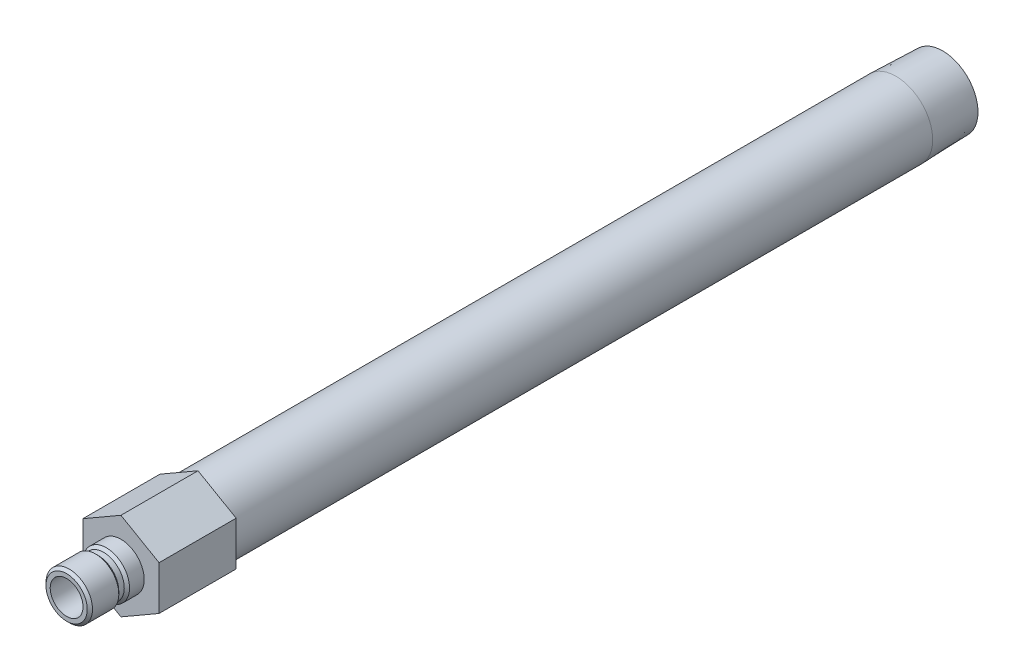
from build123d import *

# Parameters (mm, degrees)
SKETCH2_R           = 4.7625
BOSS_EXTRUDE1_DEPTH = 22.352


with BuildPart() as part:
    # Sketch1 → Revolve1 (revolve)
    with BuildSketch(Plane(origin=(0, 0, 0), x_dir=(0, 0, -1), z_dir=(1, 0, 0))):
        Polygon((-15.748, 4.7625), (-15.748, 5.9817), (-14.986, 6.7437), (-7.366, 6.7437), (-6.604, 5.9817), (-5.0165, 5.9817), (-4.2545, 6.7437), (0, 6.7437), (0, 10.668), (224.6884, 10.668), (238.252, 10.244140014), (238.252, 7.8994), (22.352, 7.8994), (22.352, 4.7625), align=None)
    revolve(axis=Axis((0, 0, 0), (0, 0, 1)))

    # Sketch2 → Boss-Extrude1 (add)
    with BuildSketch(Plane.XY):
        Polygon((-11.049, 6.379143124), (-11.049, -6.379143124), (0, -12.758286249), (11.049, -6.379143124), (11.049, 6.379143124), (0, 12.758286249), align=None)
        with Locations(Location((0, 0, 0), (0, 0, 90))):
            Circle(SKETCH2_R, mode=Mode.SUBTRACT)
    extrude(amount=-BOSS_EXTRUDE1_DEPTH)


solid = part.part
